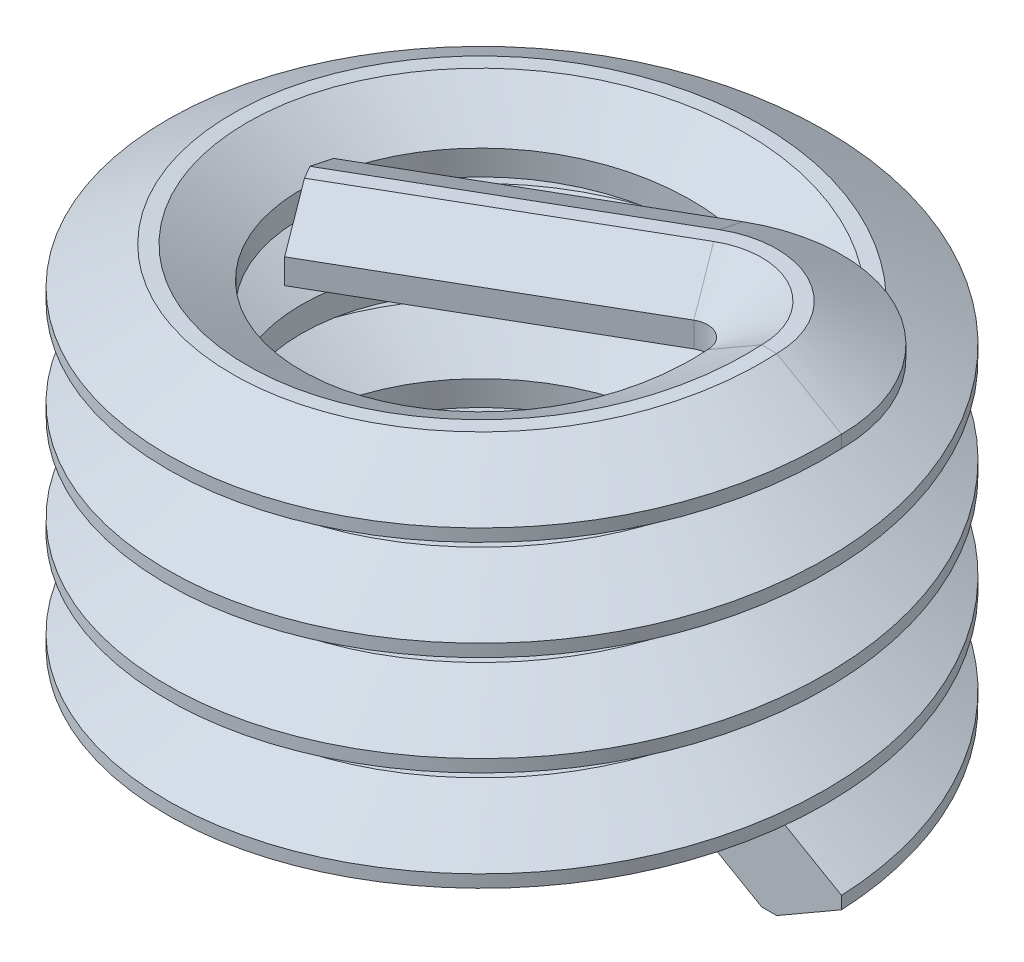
from build123d import *

# Parameters (mm, degrees)
SWEEP1_PITCH       = 1.27
SWEEP1_HEIGHT      = 5.08
SWEEP1_RADIUS      = 3.175
SWEEP1_START_ANGLE = 90
REVOLVE1_ANGLE     = 120
EXTRUDE1_DEPTH     = 3.81


with BuildPart() as part:
    # Sweep1: sweep along a helix
    with BuildLine() as sweep1_path:
        add(Helix(SWEEP1_PITCH, SWEEP1_HEIGHT, SWEEP1_RADIUS, center=(0, 0, 0), direction=(0, 1, 0), mode=Mode.PRIVATE).rotate(Axis((0, 0, 0), (0, 1, 0)), SWEEP1_START_ANGLE))
    # Sketch1 → Sweep1 (sweep)
    with BuildSketch(Plane(origin=(0, 0, 0), x_dir=(-1, 0, 0), z_dir=(0, 0, 1))):
        Polygon((-4.191, -0.079375), (-3.366110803, -0.555625), (-3.175, -0.555625), (-2.487592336, -0.15875), (-2.487592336, 0.15875), (-3.175, 0.555625), (-3.366110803, 0.555625), (-4.191, 0.079375), align=None)
    sweep(path=sweep1_path.line, is_frenet=True)


with BuildPart() as body_2:
    # Sketch3 → Revolve1 (revolve)
    with BuildSketch(Plane(origin=(0, 0, 0), x_dir=(-1, 0, 0), z_dir=(0, 0, -1))):
        Polygon((-3.175, 4.524375), (-2.487592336, 4.92125), (-2.487592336, 5.23875), (-3.175, 5.635625), (-3.366110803, 5.635625), (-4.191, 5.159375), (-4.191, 5.000625), (-3.366110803, 4.524375), align=None)
    revolve(axis=Axis((2.21262927, 5.08, 0), (0, 1, 0)), revolution_arc=REVOLVE1_ANGLE)

    # Sketch4 → Extrude1 (add)
    with BuildSketch(Plane(origin=(1.659471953, 0, -0.958096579), x_dir=(0.500000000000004, 0, 0.8660254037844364), z_dir=(-0.8660254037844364, 1.182924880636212e-15, 0.500000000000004))):
        Polygon((-0.047166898, 4.524375), (0.143943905, 4.524375), (0.831351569, 4.92125), (0.831351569, 5.23875), (0.143943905, 5.635625), (-0.047166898, 5.635625), (-0.872056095, 5.159375), (-0.872056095, 5.000625), align=None)
    extrude(amount=EXTRUDE1_DEPTH)


solid = Compound([part.part, body_2.part])
